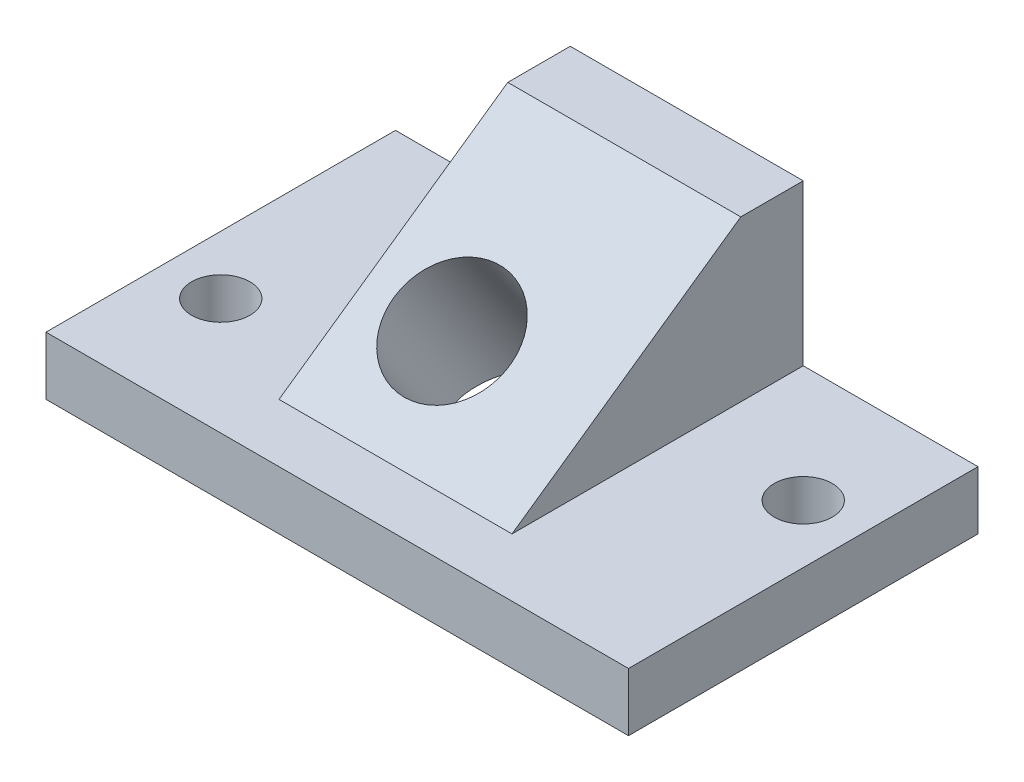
ISO-10303-21;
HEADER;
FILE_DESCRIPTION(('STEP AP214'),'2;1');
FILE_NAME('part.step','',(''),(''),'','','');
FILE_SCHEMA(('AUTOMOTIVE_DESIGN { 1 0 10303 214 1 1 1 1 }'));
ENDSEC;
DATA;
#1=APPLICATION_CONTEXT('core data for automotive mechanical design processes');
#2=APPLICATION_PROTOCOL_DEFINITION('international standard','automotive_design',2000,#1);
#3=PRODUCT_CONTEXT('',#1,'mechanical');
#4=PRODUCT('Part','Part','',(#3));
#5=PRODUCT_RELATED_PRODUCT_CATEGORY('part','',(#4));
#6=PRODUCT_DEFINITION_FORMATION('','',#4);
#7=PRODUCT_DEFINITION_CONTEXT('part definition',#1,'design');
#8=PRODUCT_DEFINITION('design','',#6,#7);
#9=PRODUCT_DEFINITION_SHAPE('','',#8);
#10=(LENGTH_UNIT() NAMED_UNIT(*) SI_UNIT(.MILLI.,.METRE.));
#11=(NAMED_UNIT(*) PLANE_ANGLE_UNIT() SI_UNIT($,.RADIAN.));
#12=(NAMED_UNIT(*) SI_UNIT($,.STERADIAN.) SOLID_ANGLE_UNIT());
#13=UNCERTAINTY_MEASURE_WITH_UNIT(LENGTH_MEASURE(1.E-05),#10,'distance_accuracy_value','');
#14=(GEOMETRIC_REPRESENTATION_CONTEXT(3) GLOBAL_UNCERTAINTY_ASSIGNED_CONTEXT((#13)) GLOBAL_UNIT_ASSIGNED_CONTEXT((#10,
#11,#12)) REPRESENTATION_CONTEXT('',''));
#15=CARTESIAN_POINT('',(0.,0.,0.));
#16=DIRECTION('',(0.,0.,1.));
#17=DIRECTION('',(1.,0.,0.));
#18=AXIS2_PLACEMENT_3D('',#15,#16,#17);
#19=CARTESIAN_POINT('',(-63.5,12.7,38.1));
#20=DIRECTION('',(-1.,0.,0.));
#21=DIRECTION('',(0.,0.,1.));
#22=AXIS2_PLACEMENT_3D('',#19,#20,#21);
#23=PLANE('',#22);
#24=DIRECTION('',(0.,0.,-1.));
#25=VECTOR('',#24,1.);
#26=CARTESIAN_POINT('',(-63.5,0.,38.1));
#27=LINE('',#26,#25);
#28=CARTESIAN_POINT('',(-63.5,0.,38.1));
#29=VERTEX_POINT('',#28);
#30=CARTESIAN_POINT('',(-63.5,0.,-38.1));
#31=VERTEX_POINT('',#30);
#32=EDGE_CURVE('E123',#29,#31,#27,.T.);
#33=ORIENTED_EDGE('',*,*,#32,.F.);
#34=DIRECTION('',(0.,-1.,0.));
#35=VECTOR('',#34,1.);
#36=CARTESIAN_POINT('',(-63.5,12.7,38.1));
#37=LINE('',#36,#35);
#38=CARTESIAN_POINT('',(-63.5,12.7,38.1));
#39=VERTEX_POINT('',#38);
#40=EDGE_CURVE('E11',#39,#29,#37,.T.);
#41=ORIENTED_EDGE('',*,*,#40,.F.);
#42=DIRECTION('',(0.,0.,-1.));
#43=VECTOR('',#42,1.);
#44=CARTESIAN_POINT('',(-63.5,12.7,38.1));
#45=LINE('',#44,#43);
#46=CARTESIAN_POINT('',(-63.5,12.7,-38.1));
#47=VERTEX_POINT('',#46);
#48=EDGE_CURVE('E135',#39,#47,#45,.T.);
#49=ORIENTED_EDGE('',*,*,#48,.T.);
#50=DIRECTION('',(0.,-1.,0.));
#51=VECTOR('',#50,1.);
#52=CARTESIAN_POINT('',(-63.5,12.7,-38.1));
#53=LINE('',#52,#51);
#54=EDGE_CURVE('E149',#47,#31,#53,.T.);
#55=ORIENTED_EDGE('',*,*,#54,.T.);
#56=EDGE_LOOP('',(#33,#41,#49,#55));
#57=FACE_BOUND('',#56,.T.);
#58=ADVANCED_FACE('F28',(#57),#23,.T.);
#59=CARTESIAN_POINT('',(-63.5,12.7,38.1));
#60=DIRECTION('',(0.,0.,-1.));
#61=DIRECTION('',(-1.,0.,0.));
#62=AXIS2_PLACEMENT_3D('',#59,#60,#61);
#63=PLANE('',#62);
#64=DIRECTION('',(1.,0.,0.));
#65=VECTOR('',#64,1.);
#66=CARTESIAN_POINT('',(-63.5,0.,38.1));
#67=LINE('',#66,#65);
#68=CARTESIAN_POINT('',(63.5,0.,38.1));
#69=VERTEX_POINT('',#68);
#70=EDGE_CURVE('E132',#29,#69,#67,.T.);
#71=ORIENTED_EDGE('',*,*,#70,.T.);
#72=DIRECTION('',(0.,-1.,0.));
#73=VECTOR('',#72,1.);
#74=CARTESIAN_POINT('',(63.5,12.7,38.1));
#75=LINE('',#74,#73);
#76=CARTESIAN_POINT('',(63.5,12.7,38.1));
#77=VERTEX_POINT('',#76);
#78=EDGE_CURVE('E37',#77,#69,#75,.T.);
#79=ORIENTED_EDGE('',*,*,#78,.F.);
#80=DIRECTION('',(1.,0.,0.));
#81=VECTOR('',#80,1.);
#82=CARTESIAN_POINT('',(-63.5,12.7,38.1));
#83=LINE('',#82,#81);
#84=EDGE_CURVE('E152',#39,#77,#83,.T.);
#85=ORIENTED_EDGE('',*,*,#84,.F.);
#86=ORIENTED_EDGE('',*,*,#40,.T.);
#87=EDGE_LOOP('',(#71,#79,#85,#86));
#88=FACE_BOUND('',#87,.T.);
#89=ADVANCED_FACE('F205',(#88),#63,.F.);
#90=CARTESIAN_POINT('',(63.5,12.7,-38.1));
#91=DIRECTION('',(1.,0.,0.));
#92=DIRECTION('',(0.,0.,-1.));
#93=AXIS2_PLACEMENT_3D('',#90,#91,#92);
#94=PLANE('',#93);
#95=DIRECTION('',(0.,0.,1.));
#96=VECTOR('',#95,1.);
#97=CARTESIAN_POINT('',(63.5,0.,-38.1));
#98=LINE('',#97,#96);
#99=CARTESIAN_POINT('',(63.5,0.,-38.1));
#100=VERTEX_POINT('',#99);
#101=EDGE_CURVE('E129',#100,#69,#98,.T.);
#102=ORIENTED_EDGE('',*,*,#101,.F.);
#103=DIRECTION('',(0.,-1.,0.));
#104=VECTOR('',#103,1.);
#105=CARTESIAN_POINT('',(63.5,12.7,-38.1));
#106=LINE('',#105,#104);
#107=CARTESIAN_POINT('',(63.5,12.7,-38.1));
#108=VERTEX_POINT('',#107);
#109=EDGE_CURVE('E151',#108,#100,#106,.T.);
#110=ORIENTED_EDGE('',*,*,#109,.F.);
#111=DIRECTION('',(0.,0.,1.));
#112=VECTOR('',#111,1.);
#113=CARTESIAN_POINT('',(63.5,12.7,-38.1));
#114=LINE('',#113,#112);
#115=EDGE_CURVE('E141',#108,#77,#114,.T.);
#116=ORIENTED_EDGE('',*,*,#115,.T.);
#117=ORIENTED_EDGE('',*,*,#78,.T.);
#118=EDGE_LOOP('',(#102,#110,#116,#117));
#119=FACE_BOUND('',#118,.T.);
#120=ADVANCED_FACE('F161',(#119),#94,.T.);
#121=CARTESIAN_POINT('',(63.5,12.7,-38.1));
#122=DIRECTION('',(0.,0.,1.));
#123=DIRECTION('',(1.,0.,0.));
#124=AXIS2_PLACEMENT_3D('',#121,#122,#123);
#125=PLANE('',#124);
#126=DIRECTION('',(-1.,0.,0.));
#127=VECTOR('',#126,1.);
#128=CARTESIAN_POINT('',(63.5,0.,-38.1));
#129=LINE('',#128,#127);
#130=EDGE_CURVE('E126',#100,#31,#129,.T.);
#131=ORIENTED_EDGE('',*,*,#130,.T.);
#132=ORIENTED_EDGE('',*,*,#54,.F.);
#133=DIRECTION('',(-1.,0.,0.));
#134=VECTOR('',#133,1.);
#135=CARTESIAN_POINT('',(63.5,12.7,-38.1));
#136=LINE('',#135,#134);
#137=CARTESIAN_POINT('',(-25.4,12.7,-38.1));
#138=VERTEX_POINT('',#137);
#139=EDGE_CURVE('E138',#138,#47,#136,.T.);
#140=ORIENTED_EDGE('',*,*,#139,.F.);
#141=DIRECTION('',(0.,-1.,0.));
#142=VECTOR('',#141,1.);
#143=CARTESIAN_POINT('',(-25.4,47.625,-38.1));
#144=LINE('',#143,#142);
#145=CARTESIAN_POINT('',(-25.4,47.625,-38.1));
#146=VERTEX_POINT('',#145);
#147=EDGE_CURVE('E120',#146,#138,#144,.T.);
#148=ORIENTED_EDGE('',*,*,#147,.F.);
#149=DIRECTION('',(1.,0.,0.));
#150=VECTOR('',#149,1.);
#151=CARTESIAN_POINT('',(-25.4,47.625,-38.1));
#152=LINE('',#151,#150);
#153=CARTESIAN_POINT('',(25.4,47.625,-38.1));
#154=VERTEX_POINT('',#153);
#155=EDGE_CURVE('E108',#146,#154,#152,.T.);
#156=ORIENTED_EDGE('',*,*,#155,.T.);
#157=DIRECTION('',(0.,-1.,0.));
#158=VECTOR('',#157,1.);
#159=CARTESIAN_POINT('',(25.4,47.625,-38.1));
#160=LINE('',#159,#158);
#161=CARTESIAN_POINT('',(25.4,12.7,-38.1));
#162=VERTEX_POINT('',#161);
#163=EDGE_CURVE('E113',#154,#162,#160,.T.);
#164=ORIENTED_EDGE('',*,*,#163,.T.);
#165=EDGE_CURVE('E147',#108,#162,#136,.T.);
#166=ORIENTED_EDGE('',*,*,#165,.F.);
#167=ORIENTED_EDGE('',*,*,#109,.T.);
#168=EDGE_LOOP('',(#131,#132,#140,#148,#156,#164,#166,#167));
#169=FACE_BOUND('',#168,.T.);
#170=ADVANCED_FACE('F165',(#169),#125,.F.);
#171=CARTESIAN_POINT('',(-63.5,12.7,38.1));
#172=DIRECTION('',(0.,-1.,0.));
#173=DIRECTION('',(0.,0.,-1.));
#174=AXIS2_PLACEMENT_3D('',#171,#172,#173);
#175=PLANE('',#174);
#176=CARTESIAN_POINT('',(-50.8,12.700000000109,12.7));
#177=DIRECTION('',(0.,1.,0.));
#178=DIRECTION('',(0.,0.,1.));
#179=AXIS2_PLACEMENT_3D('',#176,#177,#178);
#180=CIRCLE('',#179,6.35);
#181=CARTESIAN_POINT('',(-50.8,12.700000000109,19.05));
#182=VERTEX_POINT('',#181);
#183=EDGE_CURVE('E180',#182,#182,#180,.T.);
#184=ORIENTED_EDGE('',*,*,#183,.F.);
#185=EDGE_LOOP('',(#184));
#186=FACE_BOUND('',#185,.T.);
#187=CARTESIAN_POINT('',(50.8,12.700000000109,-12.7));
#188=DIRECTION('',(0.,1.,0.));
#189=DIRECTION('',(0.,0.,1.));
#190=AXIS2_PLACEMENT_3D('',#187,#188,#189);
#191=CIRCLE('',#190,6.35);
#192=CARTESIAN_POINT('',(50.8,12.700000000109,-6.35));
#193=VERTEX_POINT('',#192);
#194=EDGE_CURVE('E169',#193,#193,#191,.T.);
#195=ORIENTED_EDGE('',*,*,#194,.F.);
#196=EDGE_LOOP('',(#195));
#197=FACE_BOUND('',#196,.T.);
#198=ORIENTED_EDGE('',*,*,#165,.T.);
#199=DIRECTION('',(0.,0.,1.));
#200=VECTOR('',#199,1.);
#201=CARTESIAN_POINT('',(25.4,12.7,-38.1));
#202=LINE('',#201,#200);
#203=CARTESIAN_POINT('',(25.4,12.7,25.4));
#204=VERTEX_POINT('',#203);
#205=EDGE_CURVE('E31',#162,#204,#202,.T.);
#206=ORIENTED_EDGE('',*,*,#205,.T.);
#207=DIRECTION('',(1.,0.,0.));
#208=VECTOR('',#207,1.);
#209=CARTESIAN_POINT('',(-25.4,12.7,25.4));
#210=LINE('',#209,#208);
#211=CARTESIAN_POINT('',(-25.4,12.7,25.4));
#212=VERTEX_POINT('',#211);
#213=EDGE_CURVE('E98',#212,#204,#210,.T.);
#214=ORIENTED_EDGE('',*,*,#213,.F.);
#215=DIRECTION('',(0.,0.,1.));
#216=VECTOR('',#215,1.);
#217=CARTESIAN_POINT('',(-25.4,12.7,-38.1));
#218=LINE('',#217,#216);
#219=EDGE_CURVE('E50',#138,#212,#218,.T.);
#220=ORIENTED_EDGE('',*,*,#219,.F.);
#221=ORIENTED_EDGE('',*,*,#139,.T.);
#222=ORIENTED_EDGE('',*,*,#48,.F.);
#223=ORIENTED_EDGE('',*,*,#84,.T.);
#224=ORIENTED_EDGE('',*,*,#115,.F.);
#225=EDGE_LOOP('',(#198,#206,#214,#220,#221,#222,#223,#224));
#226=FACE_BOUND('',#225,.T.);
#227=ADVANCED_FACE('F163',(#186,#197,#226),#175,.F.);
#228=CARTESIAN_POINT('',(-63.5,0.,38.1));
#229=DIRECTION('',(0.,-1.,0.));
#230=DIRECTION('',(0.,0.,-1.));
#231=AXIS2_PLACEMENT_3D('',#228,#229,#230);
#232=PLANE('',#231);
#233=CARTESIAN_POINT('',(-6.35,0.,-11.3139413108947));
#234=DIRECTION('',(0.,-1.,0.));
#235=DIRECTION('',(0.,0.,1.));
#236=AXIS2_PLACEMENT_3D('',#233,#234,#235);
#237=ELLIPSE('',#236,15.5038372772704,12.7);
#238=CARTESIAN_POINT('',(-6.35,0.,4.18989596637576));
#239=VERTEX_POINT('',#238);
#240=EDGE_CURVE('E183',#239,#239,#237,.T.);
#241=ORIENTED_EDGE('',*,*,#240,.F.);
#242=EDGE_LOOP('',(#241));
#243=FACE_BOUND('',#242,.T.);
#244=CARTESIAN_POINT('',(-50.8,0.,12.7));
#245=DIRECTION('',(0.,1.,0.));
#246=DIRECTION('',(0.,0.,1.));
#247=AXIS2_PLACEMENT_3D('',#244,#245,#246);
#248=CIRCLE('',#247,6.35);
#249=CARTESIAN_POINT('',(-50.8,0.,19.05));
#250=VERTEX_POINT('',#249);
#251=EDGE_CURVE('E174',#250,#250,#248,.T.);
#252=ORIENTED_EDGE('',*,*,#251,.T.);
#253=EDGE_LOOP('',(#252));
#254=FACE_BOUND('',#253,.T.);
#255=CARTESIAN_POINT('',(50.8,0.,-12.7));
#256=DIRECTION('',(0.,1.,0.));
#257=DIRECTION('',(0.,0.,1.));
#258=AXIS2_PLACEMENT_3D('',#255,#256,#257);
#259=CIRCLE('',#258,6.35);
#260=CARTESIAN_POINT('',(50.8,0.,-6.35));
#261=VERTEX_POINT('',#260);
#262=EDGE_CURVE('E167',#261,#261,#259,.T.);
#263=ORIENTED_EDGE('',*,*,#262,.T.);
#264=EDGE_LOOP('',(#263));
#265=FACE_BOUND('',#264,.T.);
#266=ORIENTED_EDGE('',*,*,#32,.T.);
#267=ORIENTED_EDGE('',*,*,#130,.F.);
#268=ORIENTED_EDGE('',*,*,#101,.T.);
#269=ORIENTED_EDGE('',*,*,#70,.F.);
#270=EDGE_LOOP('',(#266,#267,#268,#269));
#271=FACE_BOUND('',#270,.T.);
#272=ADVANCED_FACE('F193',(#243,#254,#265,#271),#232,.T.);
#273=CARTESIAN_POINT('',(-25.4,12.7,25.4));
#274=DIRECTION('',(0.,-0.819152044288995,-0.573576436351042));
#275=DIRECTION('',(0.,0.573576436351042,-0.819152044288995));
#276=AXIS2_PLACEMENT_3D('',#273,#274,#275);
#277=PLANE('',#276);
#278=CARTESIAN_POINT('',(-6.35,25.7717377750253,6.73162375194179));
#279=DIRECTION('',(0.,0.819152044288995,0.573576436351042));
#280=DIRECTION('',(0.,-0.573576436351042,0.819152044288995));
#281=AXIS2_PLACEMENT_3D('',#278,#279,#280);
#282=CIRCLE('',#281,12.7);
#283=CARTESIAN_POINT('',(-6.35,18.4873170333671,17.134854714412));
#284=VERTEX_POINT('',#283);
#285=EDGE_CURVE('E186',#284,#284,#282,.T.);
#286=ORIENTED_EDGE('',*,*,#285,.F.);
#287=EDGE_LOOP('',(#286));
#288=FACE_BOUND('',#287,.T.);
#289=DIRECTION('',(0.,0.573576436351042,-0.819152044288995));
#290=VECTOR('',#289,1.);
#291=CARTESIAN_POINT('',(25.4,12.7,25.4));
#292=LINE('',#291,#290);
#293=CARTESIAN_POINT('',(25.4,47.625,-24.4780691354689));
#294=VERTEX_POINT('',#293);
#295=EDGE_CURVE('E92',#204,#294,#292,.T.);
#296=ORIENTED_EDGE('',*,*,#295,.T.);
#297=DIRECTION('',(1.,0.,0.));
#298=VECTOR('',#297,1.);
#299=CARTESIAN_POINT('',(-25.4,47.625,-24.4780691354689));
#300=LINE('',#299,#298);
#301=CARTESIAN_POINT('',(-25.4,47.625,-24.4780691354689));
#302=VERTEX_POINT('',#301);
#303=EDGE_CURVE('E96',#302,#294,#300,.T.);
#304=ORIENTED_EDGE('',*,*,#303,.F.);
#305=DIRECTION('',(0.,0.573576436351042,-0.819152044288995));
#306=VECTOR('',#305,1.);
#307=CARTESIAN_POINT('',(-25.4,12.7,25.4));
#308=LINE('',#307,#306);
#309=EDGE_CURVE('E117',#212,#302,#308,.T.);
#310=ORIENTED_EDGE('',*,*,#309,.F.);
#311=ORIENTED_EDGE('',*,*,#213,.T.);
#312=EDGE_LOOP('',(#296,#304,#310,#311));
#313=FACE_BOUND('',#312,.T.);
#314=ADVANCED_FACE('F94',(#288,#313),#277,.F.);
#315=CARTESIAN_POINT('',(-25.4,47.625,-24.4780691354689));
#316=DIRECTION('',(0.,-1.,0.));
#317=DIRECTION('',(0.,0.,-1.));
#318=AXIS2_PLACEMENT_3D('',#315,#316,#317);
#319=PLANE('',#318);
#320=DIRECTION('',(0.,0.,-1.));
#321=VECTOR('',#320,1.);
#322=CARTESIAN_POINT('',(25.4,47.625,-24.4780691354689));
#323=LINE('',#322,#321);
#324=EDGE_CURVE('E101',#294,#154,#323,.T.);
#325=ORIENTED_EDGE('',*,*,#324,.T.);
#326=ORIENTED_EDGE('',*,*,#155,.F.);
#327=DIRECTION('',(0.,0.,-1.));
#328=VECTOR('',#327,1.);
#329=CARTESIAN_POINT('',(-25.4,47.625,-24.4780691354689));
#330=LINE('',#329,#328);
#331=EDGE_CURVE('E107',#302,#146,#330,.T.);
#332=ORIENTED_EDGE('',*,*,#331,.F.);
#333=ORIENTED_EDGE('',*,*,#303,.T.);
#334=EDGE_LOOP('',(#325,#326,#332,#333));
#335=FACE_BOUND('',#334,.T.);
#336=ADVANCED_FACE('F104',(#335),#319,.F.);
#337=CARTESIAN_POINT('',(-25.4,12.7,-38.1));
#338=DIRECTION('',(1.,0.,0.));
#339=DIRECTION('',(0.,0.,-1.));
#340=AXIS2_PLACEMENT_3D('',#337,#338,#339);
#341=PLANE('',#340);
#342=ORIENTED_EDGE('',*,*,#219,.T.);
#343=ORIENTED_EDGE('',*,*,#309,.T.);
#344=ORIENTED_EDGE('',*,*,#331,.T.);
#345=ORIENTED_EDGE('',*,*,#147,.T.);
#346=EDGE_LOOP('',(#342,#343,#344,#345));
#347=FACE_BOUND('',#346,.T.);
#348=ADVANCED_FACE('F200',(#347),#341,.F.);
#349=CARTESIAN_POINT('',(25.4,12.7,-38.1));
#350=DIRECTION('',(1.,0.,0.));
#351=DIRECTION('',(0.,0.,-1.));
#352=AXIS2_PLACEMENT_3D('',#349,#350,#351);
#353=PLANE('',#352);
#354=ORIENTED_EDGE('',*,*,#205,.F.);
#355=ORIENTED_EDGE('',*,*,#163,.F.);
#356=ORIENTED_EDGE('',*,*,#324,.F.);
#357=ORIENTED_EDGE('',*,*,#295,.F.);
#358=EDGE_LOOP('',(#354,#355,#356,#357));
#359=FACE_BOUND('',#358,.T.);
#360=ADVANCED_FACE('F111',(#359),#353,.T.);
#361=CARTESIAN_POINT('',(50.8,0.,-12.7));
#362=DIRECTION('',(0.,1.,0.));
#363=DIRECTION('',(0.,0.,1.));
#364=AXIS2_PLACEMENT_3D('',#361,#362,#363);
#365=CYLINDRICAL_SURFACE('',#364,6.35);
#366=ORIENTED_EDGE('',*,*,#262,.F.);
#367=EDGE_LOOP('',(#366));
#368=FACE_BOUND('',#367,.T.);
#369=ORIENTED_EDGE('',*,*,#194,.T.);
#370=EDGE_LOOP('',(#369));
#371=FACE_BOUND('',#370,.T.);
#372=ADVANCED_FACE('F230',(#368,#371),#365,.F.);
#373=CARTESIAN_POINT('',(-50.8,0.,12.7));
#374=DIRECTION('',(0.,1.,0.));
#375=DIRECTION('',(0.,0.,1.));
#376=AXIS2_PLACEMENT_3D('',#373,#374,#375);
#377=CYLINDRICAL_SURFACE('',#376,6.35);
#378=ORIENTED_EDGE('',*,*,#251,.F.);
#379=EDGE_LOOP('',(#378));
#380=FACE_BOUND('',#379,.T.);
#381=ORIENTED_EDGE('',*,*,#183,.T.);
#382=EDGE_LOOP('',(#381));
#383=FACE_BOUND('',#382,.T.);
#384=ADVANCED_FACE('F235',(#380,#383),#377,.F.);
#385=CARTESIAN_POINT('',(-6.35,-12.5853543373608,-20.1263012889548));
#386=DIRECTION('',(0.,0.819152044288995,0.573576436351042));
#387=DIRECTION('',(0.,-0.573576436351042,0.819152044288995));
#388=AXIS2_PLACEMENT_3D('',#385,#386,#387);
#389=CYLINDRICAL_SURFACE('',#388,12.7);
#390=ORIENTED_EDGE('',*,*,#240,.T.);
#391=EDGE_LOOP('',(#390));
#392=FACE_BOUND('',#391,.T.);
#393=ORIENTED_EDGE('',*,*,#285,.T.);
#394=EDGE_LOOP('',(#393));
#395=FACE_BOUND('',#394,.T.);
#396=ADVANCED_FACE('F190',(#392,#395),#389,.F.);
#397=CLOSED_SHELL('',(#58,#89,#120,#170,#227,#272,#314,#336,#348,#360,#372,#384,#396));
#398=MANIFOLD_SOLID_BREP('B2',#397);
#399=ADVANCED_BREP_SHAPE_REPRESENTATION('',(#18,#398),#14);
#400=SHAPE_DEFINITION_REPRESENTATION(#9,#399);
ENDSEC;
END-ISO-10303-21;
